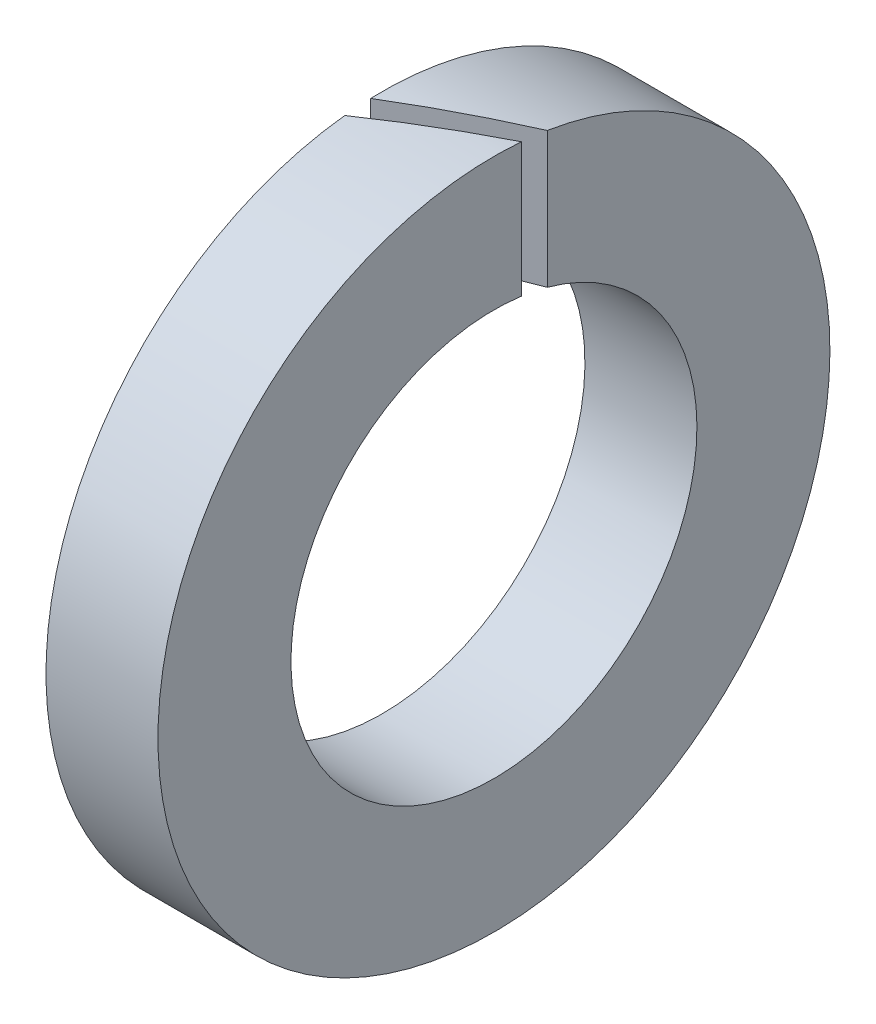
ISO-10303-21;
HEADER;
FILE_DESCRIPTION(('STEP AP214'),'2;1');
FILE_NAME('part.step','',(''),(''),'','','');
FILE_SCHEMA(('AUTOMOTIVE_DESIGN { 1 0 10303 214 1 1 1 1 }'));
ENDSEC;
DATA;
#1=APPLICATION_CONTEXT('core data for automotive mechanical design processes');
#2=APPLICATION_PROTOCOL_DEFINITION('international standard','automotive_design',2000,#1);
#3=PRODUCT_CONTEXT('',#1,'mechanical');
#4=PRODUCT('Part','Part','',(#3));
#5=PRODUCT_RELATED_PRODUCT_CATEGORY('part','',(#4));
#6=PRODUCT_DEFINITION_FORMATION('','',#4);
#7=PRODUCT_DEFINITION_CONTEXT('part definition',#1,'design');
#8=PRODUCT_DEFINITION('design','',#6,#7);
#9=PRODUCT_DEFINITION_SHAPE('','',#8);
#10=(LENGTH_UNIT() NAMED_UNIT(*) SI_UNIT(.MILLI.,.METRE.));
#11=(NAMED_UNIT(*) PLANE_ANGLE_UNIT() SI_UNIT($,.RADIAN.));
#12=(NAMED_UNIT(*) SI_UNIT($,.STERADIAN.) SOLID_ANGLE_UNIT());
#13=UNCERTAINTY_MEASURE_WITH_UNIT(LENGTH_MEASURE(1.E-05),#10,'distance_accuracy_value','');
#14=(GEOMETRIC_REPRESENTATION_CONTEXT(3) GLOBAL_UNCERTAINTY_ASSIGNED_CONTEXT((#13)) GLOBAL_UNIT_ASSIGNED_CONTEXT((#10,
#11,#12)) REPRESENTATION_CONTEXT('',''));
#15=CARTESIAN_POINT('',(0.,0.,0.));
#16=DIRECTION('',(0.,0.,1.));
#17=DIRECTION('',(1.,0.,0.));
#18=AXIS2_PLACEMENT_3D('',#15,#16,#17);
#19=CARTESIAN_POINT('',(4.,0.,0.));
#20=DIRECTION('',(1.,0.,0.));
#21=DIRECTION('',(0.,0.,-1.));
#22=AXIS2_PLACEMENT_3D('',#19,#20,#21);
#23=PLANE('',#22);
#24=CARTESIAN_POINT('',(4.,0.,0.));
#25=DIRECTION('',(1.,0.,0.));
#26=DIRECTION('',(0.,0.,-1.));
#27=AXIS2_PLACEMENT_3D('',#24,#25,#26);
#28=CIRCLE('',#27,12.);
#29=CARTESIAN_POINT('',(4.00000000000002,11.9597940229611,-0.981492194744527));
#30=VERTEX_POINT('',#29);
#31=CARTESIAN_POINT('',(4.00000000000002,11.8477846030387,-1.90525588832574));
#32=VERTEX_POINT('',#31);
#33=EDGE_CURVE('E76',#30,#32,#28,.T.);
#34=ORIENTED_EDGE('',*,*,#33,.T.);
#35=DIRECTION('',(0.,-1.,0.));
#36=VECTOR('',#35,1.);
#37=CARTESIAN_POINT('',(4.,0.,-1.90525588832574));
#38=LINE('',#37,#36);
#39=CARTESIAN_POINT('',(4.00000000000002,6.99517690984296,-1.9052558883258));
#40=VERTEX_POINT('',#39);
#41=EDGE_CURVE('E90',#32,#40,#38,.T.);
#42=ORIENTED_EDGE('',*,*,#41,.T.);
#43=CARTESIAN_POINT('',(4.,0.,0.));
#44=DIRECTION('',(1.,0.,0.));
#45=DIRECTION('',(0.,0.,-1.));
#46=AXIS2_PLACEMENT_3D('',#43,#44,#45);
#47=CIRCLE('',#46,7.25);
#48=CARTESIAN_POINT('',(4.00000000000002,7.18325643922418,-0.981492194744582));
#49=VERTEX_POINT('',#48);
#50=EDGE_CURVE('E86',#49,#40,#47,.T.);
#51=ORIENTED_EDGE('',*,*,#50,.F.);
#52=DIRECTION('',(0.,1.,0.));
#53=VECTOR('',#52,1.);
#54=CARTESIAN_POINT('',(4.,0.,-0.981492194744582));
#55=LINE('',#54,#53);
#56=EDGE_CURVE('E53',#49,#30,#55,.T.);
#57=ORIENTED_EDGE('',*,*,#56,.T.);
#58=EDGE_LOOP('',(#34,#42,#51,#57));
#59=FACE_BOUND('',#58,.T.);
#60=ADVANCED_FACE('F31',(#59),#23,.T.);
#61=CARTESIAN_POINT('',(0.,0.,0.));
#62=DIRECTION('',(1.,0.,0.));
#63=DIRECTION('',(0.,0.,-1.));
#64=AXIS2_PLACEMENT_3D('',#61,#62,#63);
#65=PLANE('',#64);
#66=DIRECTION('',(0.,-1.,0.));
#67=VECTOR('',#66,1.);
#68=CARTESIAN_POINT('',(0.,0.,0.404145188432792));
#69=LINE('',#68,#67);
#70=CARTESIAN_POINT('',(0.,11.9931925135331,0.404145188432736));
#71=VERTEX_POINT('',#70);
#72=CARTESIAN_POINT('',(0.,7.23872686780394,0.404145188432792));
#73=VERTEX_POINT('',#72);
#74=EDGE_CURVE('E46',#71,#73,#69,.T.);
#75=ORIENTED_EDGE('',*,*,#74,.F.);
#76=CARTESIAN_POINT('',(0.,0.,0.));
#77=DIRECTION('',(1.,0.,0.));
#78=DIRECTION('',(0.,0.,-1.));
#79=AXIS2_PLACEMENT_3D('',#76,#77,#78);
#80=CIRCLE('',#79,12.);
#81=CARTESIAN_POINT('',(0.,11.9263011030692,1.32790888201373));
#82=VERTEX_POINT('',#81);
#83=EDGE_CURVE('E83',#82,#71,#80,.T.);
#84=ORIENTED_EDGE('',*,*,#83,.F.);
#85=DIRECTION('',(0.,1.,0.));
#86=VECTOR('',#85,1.);
#87=CARTESIAN_POINT('',(0.,0.,1.32790888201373));
#88=LINE('',#87,#86);
#89=CARTESIAN_POINT('',(0.,7.12735280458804,1.32790888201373));
#90=VERTEX_POINT('',#89);
#91=EDGE_CURVE('E70',#90,#82,#88,.T.);
#92=ORIENTED_EDGE('',*,*,#91,.F.);
#93=CARTESIAN_POINT('',(0.,0.,0.));
#94=DIRECTION('',(1.,0.,0.));
#95=DIRECTION('',(0.,0.,-1.));
#96=AXIS2_PLACEMENT_3D('',#93,#94,#95);
#97=CIRCLE('',#96,7.25);
#98=EDGE_CURVE('E81',#90,#73,#97,.T.);
#99=ORIENTED_EDGE('',*,*,#98,.T.);
#100=EDGE_LOOP('',(#75,#84,#92,#99));
#101=FACE_BOUND('',#100,.T.);
#102=ADVANCED_FACE('F80',(#101),#65,.F.);
#103=CARTESIAN_POINT('',(4.,0.,0.));
#104=DIRECTION('',(-1.,0.,0.));
#105=DIRECTION('',(0.,0.,1.));
#106=AXIS2_PLACEMENT_3D('',#103,#104,#105);
#107=CYLINDRICAL_SURFACE('',#106,12.);
#108=CARTESIAN_POINT('',(0.700000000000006,0.,0.));
#109=DIRECTION('',(0.5,0.,0.866025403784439));
#110=DIRECTION('',(-0.866025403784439,0.,0.5));
#111=AXIS2_PLACEMENT_3D('',#108,#109,#110);
#112=ELLIPSE('',#111,24.,12.);
#113=EDGE_CURVE('E87',#32,#71,#112,.T.);
#114=ORIENTED_EDGE('',*,*,#113,.F.);
#115=ORIENTED_EDGE('',*,*,#33,.F.);
#116=CARTESIAN_POINT('',(2.30000565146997,0.,0.));
#117=DIRECTION('',(-0.499999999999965,0.,-0.866025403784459));
#118=DIRECTION('',(-0.866025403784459,0.,0.499999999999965));
#119=AXIS2_PLACEMENT_3D('',#116,#117,#118);
#120=ELLIPSE('',#119,24.0000000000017,12.);
#121=EDGE_CURVE('E101',#82,#30,#120,.T.);
#122=ORIENTED_EDGE('',*,*,#121,.F.);
#123=ORIENTED_EDGE('',*,*,#83,.T.);
#124=EDGE_LOOP('',(#114,#115,#122,#123));
#125=FACE_BOUND('',#124,.T.);
#126=ADVANCED_FACE('F33',(#125),#107,.T.);
#127=CARTESIAN_POINT('',(4.,0.,0.));
#128=DIRECTION('',(-1.,0.,0.));
#129=DIRECTION('',(0.,0.,1.));
#130=AXIS2_PLACEMENT_3D('',#127,#128,#129);
#131=CYLINDRICAL_SURFACE('',#130,7.25);
#132=ORIENTED_EDGE('',*,*,#50,.T.);
#133=CARTESIAN_POINT('',(0.700000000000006,0.,0.));
#134=DIRECTION('',(0.5,0.,0.866025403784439));
#135=DIRECTION('',(-0.866025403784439,0.,0.5));
#136=AXIS2_PLACEMENT_3D('',#133,#134,#135);
#137=ELLIPSE('',#136,14.5,7.25);
#138=EDGE_CURVE('E11',#40,#73,#137,.T.);
#139=ORIENTED_EDGE('',*,*,#138,.T.);
#140=ORIENTED_EDGE('',*,*,#98,.F.);
#141=CARTESIAN_POINT('',(2.30000565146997,0.,0.));
#142=DIRECTION('',(-0.499999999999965,0.,-0.866025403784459));
#143=DIRECTION('',(-0.866025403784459,0.,0.499999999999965));
#144=AXIS2_PLACEMENT_3D('',#141,#142,#143);
#145=ELLIPSE('',#144,14.500000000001,7.25);
#146=EDGE_CURVE('E39',#90,#49,#145,.T.);
#147=ORIENTED_EDGE('',*,*,#146,.T.);
#148=EDGE_LOOP('',(#132,#139,#140,#147));
#149=FACE_BOUND('',#148,.T.);
#150=ADVANCED_FACE('F85',(#149),#131,.F.);
#151=CARTESIAN_POINT('',(-0.0889807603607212,12.,1.37928194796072));
#152=DIRECTION('',(-0.499999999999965,0.,-0.866025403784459));
#153=DIRECTION('',(-0.866025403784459,0.,0.499999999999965));
#154=AXIS2_PLACEMENT_3D('',#151,#152,#153);
#155=PLANE('',#154);
#156=ORIENTED_EDGE('',*,*,#121,.T.);
#157=ORIENTED_EDGE('',*,*,#56,.F.);
#158=ORIENTED_EDGE('',*,*,#146,.F.);
#159=ORIENTED_EDGE('',*,*,#91,.T.);
#160=EDGE_LOOP('',(#156,#157,#158,#159));
#161=FACE_BOUND('',#160,.T.);
#162=ADVANCED_FACE('F69',(#161),#155,.T.);
#163=CARTESIAN_POINT('',(-0.442762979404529,12.,0.65977451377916));
#164=DIRECTION('',(0.5,0.,0.866025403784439));
#165=DIRECTION('',(0.866025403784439,0.,-0.5));
#166=AXIS2_PLACEMENT_3D('',#163,#164,#165);
#167=PLANE('',#166);
#168=ORIENTED_EDGE('',*,*,#113,.T.);
#169=ORIENTED_EDGE('',*,*,#74,.T.);
#170=ORIENTED_EDGE('',*,*,#138,.F.);
#171=ORIENTED_EDGE('',*,*,#41,.F.);
#172=EDGE_LOOP('',(#168,#169,#170,#171));
#173=FACE_BOUND('',#172,.T.);
#174=ADVANCED_FACE('F102',(#173),#167,.T.);
#175=CLOSED_SHELL('',(#60,#102,#126,#150,#162,#174));
#176=MANIFOLD_SOLID_BREP('B2',#175);
#177=ADVANCED_BREP_SHAPE_REPRESENTATION('',(#18,#176),#14);
#178=SHAPE_DEFINITION_REPRESENTATION(#9,#177);
ENDSEC;
END-ISO-10303-21;
